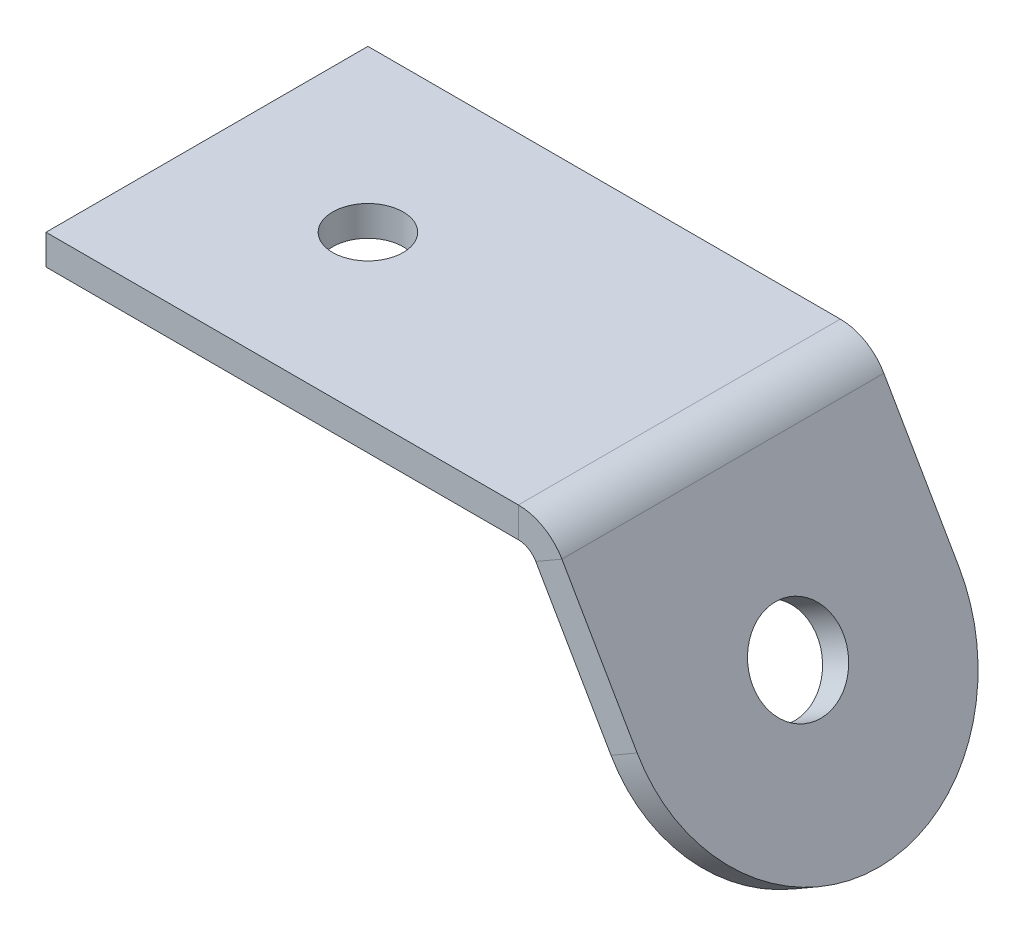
ISO-10303-21;
HEADER;
FILE_DESCRIPTION(('STEP AP214'),'2;1');
FILE_NAME('part.step','',(''),(''),'','','');
FILE_SCHEMA(('AUTOMOTIVE_DESIGN { 1 0 10303 214 1 1 1 1 }'));
ENDSEC;
DATA;
#1=APPLICATION_CONTEXT('core data for automotive mechanical design processes');
#2=APPLICATION_PROTOCOL_DEFINITION('international standard','automotive_design',2000,#1);
#3=PRODUCT_CONTEXT('',#1,'mechanical');
#4=PRODUCT('Part','Part','',(#3));
#5=PRODUCT_RELATED_PRODUCT_CATEGORY('part','',(#4));
#6=PRODUCT_DEFINITION_FORMATION('','',#4);
#7=PRODUCT_DEFINITION_CONTEXT('part definition',#1,'design');
#8=PRODUCT_DEFINITION('design','',#6,#7);
#9=PRODUCT_DEFINITION_SHAPE('','',#8);
#10=(LENGTH_UNIT() NAMED_UNIT(*) SI_UNIT(.MILLI.,.METRE.));
#11=(NAMED_UNIT(*) PLANE_ANGLE_UNIT() SI_UNIT($,.RADIAN.));
#12=(NAMED_UNIT(*) SI_UNIT($,.STERADIAN.) SOLID_ANGLE_UNIT());
#13=UNCERTAINTY_MEASURE_WITH_UNIT(LENGTH_MEASURE(1.E-05),#10,'distance_accuracy_value','');
#14=(GEOMETRIC_REPRESENTATION_CONTEXT(3) GLOBAL_UNCERTAINTY_ASSIGNED_CONTEXT((#13)) GLOBAL_UNIT_ASSIGNED_CONTEXT((#10,
#11,#12)) REPRESENTATION_CONTEXT('',''));
#15=CARTESIAN_POINT('',(0.,0.,0.));
#16=DIRECTION('',(0.,0.,1.));
#17=DIRECTION('',(1.,0.,0.));
#18=AXIS2_PLACEMENT_3D('',#15,#16,#17);
#19=CARTESIAN_POINT('',(13.3796535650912,21.4880663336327,-16.));
#20=DIRECTION('',(0.,0.,1.));
#21=DIRECTION('',(0.499999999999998,-0.86602540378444,0.));
#22=AXIS2_PLACEMENT_3D('',#19,#20,#21);
#23=PLANE('',#22);
#24=DIRECTION('',(-0.499999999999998,0.86602540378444,0.));
#25=VECTOR('',#24,1.);
#26=CARTESIAN_POINT('',(12.0806154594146,20.7380663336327,-16.));
#27=LINE('',#26,#25);
#28=CARTESIAN_POINT('',(28.0806154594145,-6.97474658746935,-16.));
#29=VERTEX_POINT('',#28);
#30=CARTESIAN_POINT('',(24.3424187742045,-0.500000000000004,-16.));
#31=VERTEX_POINT('',#30);
#32=EDGE_CURVE('E60',#29,#31,#27,.T.);
#33=ORIENTED_EDGE('',*,*,#32,.T.);
#34=DIRECTION('',(0.86602540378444,0.499999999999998,0.));
#35=VECTOR('',#34,1.);
#36=CARTESIAN_POINT('',(25.6414568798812,0.249999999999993,-16.));
#37=LINE('',#36,#35);
#38=CARTESIAN_POINT('',(25.6414568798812,0.249999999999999,-16.));
#39=VERTEX_POINT('',#38);
#40=EDGE_CURVE('E187',#31,#39,#37,.T.);
#41=ORIENTED_EDGE('',*,*,#40,.T.);
#42=DIRECTION('',(-0.499999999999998,0.86602540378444,0.));
#43=VECTOR('',#42,1.);
#44=CARTESIAN_POINT('',(13.3796535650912,21.4880663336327,-16.));
#45=LINE('',#44,#43);
#46=CARTESIAN_POINT('',(29.3796535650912,-6.22474658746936,-16.));
#47=VERTEX_POINT('',#46);
#48=EDGE_CURVE('E178',#47,#39,#45,.T.);
#49=ORIENTED_EDGE('',*,*,#48,.F.);
#50=DIRECTION('',(-0.86602540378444,-0.499999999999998,0.));
#51=VECTOR('',#50,1.);
#52=CARTESIAN_POINT('',(29.3796535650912,-6.22474658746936,-16.));
#53=LINE('',#52,#51);
#54=EDGE_CURVE('E181',#47,#29,#53,.T.);
#55=ORIENTED_EDGE('',*,*,#54,.T.);
#56=EDGE_LOOP('',(#33,#41,#49,#55));
#57=FACE_BOUND('',#56,.T.);
#58=ADVANCED_FACE('F36',(#57),#23,.F.);
#59=CARTESIAN_POINT('',(13.3796535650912,21.4880663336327,0.));
#60=DIRECTION('',(0.,0.,-1.));
#61=DIRECTION('',(-0.499999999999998,0.86602540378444,0.));
#62=AXIS2_PLACEMENT_3D('',#59,#60,#61);
#63=PLANE('',#62);
#64=DIRECTION('',(0.499999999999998,-0.86602540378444,0.));
#65=VECTOR('',#64,1.);
#66=CARTESIAN_POINT('',(13.3796535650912,21.4880663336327,0.));
#67=LINE('',#66,#65);
#68=CARTESIAN_POINT('',(25.6414568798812,0.249999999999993,0.));
#69=VERTEX_POINT('',#68);
#70=CARTESIAN_POINT('',(29.3796535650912,-6.22474658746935,0.));
#71=VERTEX_POINT('',#70);
#72=EDGE_CURVE('E40',#69,#71,#67,.T.);
#73=ORIENTED_EDGE('',*,*,#72,.F.);
#74=DIRECTION('',(-0.86602540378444,-0.499999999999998,0.));
#75=VECTOR('',#74,1.);
#76=CARTESIAN_POINT('',(25.6414568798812,0.249999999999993,0.));
#77=LINE('',#76,#75);
#78=CARTESIAN_POINT('',(24.3424187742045,-0.500000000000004,0.));
#79=VERTEX_POINT('',#78);
#80=EDGE_CURVE('E12',#69,#79,#77,.T.);
#81=ORIENTED_EDGE('',*,*,#80,.T.);
#82=DIRECTION('',(0.499999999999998,-0.86602540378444,0.));
#83=VECTOR('',#82,1.);
#84=CARTESIAN_POINT('',(12.0806154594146,20.7380663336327,0.));
#85=LINE('',#84,#83);
#86=CARTESIAN_POINT('',(28.0806154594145,-6.97474658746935,0.));
#87=VERTEX_POINT('',#86);
#88=EDGE_CURVE('E53',#79,#87,#85,.T.);
#89=ORIENTED_EDGE('',*,*,#88,.T.);
#90=DIRECTION('',(-0.86602540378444,-0.499999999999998,0.));
#91=VECTOR('',#90,1.);
#92=CARTESIAN_POINT('',(29.3796535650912,-6.22474658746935,0.));
#93=LINE('',#92,#91);
#94=EDGE_CURVE('E183',#71,#87,#93,.T.);
#95=ORIENTED_EDGE('',*,*,#94,.F.);
#96=EDGE_LOOP('',(#73,#81,#89,#95));
#97=FACE_BOUND('',#96,.T.);
#98=ADVANCED_FACE('F38',(#97),#63,.F.);
#99=CARTESIAN_POINT('',(28.0806154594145,-6.97474658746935,-8.));
#100=DIRECTION('',(0.86602540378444,0.499999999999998,0.));
#101=DIRECTION('',(0.,0.,1.));
#102=AXIS2_PLACEMENT_3D('',#99,#100,#101);
#103=PLANE('',#102);
#104=CARTESIAN_POINT('',(28.0806154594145,-6.97474658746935,-8.));
#105=DIRECTION('',(0.86602540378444,0.499999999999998,0.));
#106=DIRECTION('',(0.,0.,1.));
#107=AXIS2_PLACEMENT_3D('',#104,#105,#106);
#108=CIRCLE('',#107,2.25);
#109=CARTESIAN_POINT('',(28.0806154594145,-6.97474658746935,-5.75));
#110=VERTEX_POINT('',#109);
#111=EDGE_CURVE('E153',#110,#110,#108,.T.);
#112=ORIENTED_EDGE('',*,*,#111,.T.);
#113=EDGE_LOOP('',(#112));
#114=FACE_BOUND('',#113,.T.);
#115=ORIENTED_EDGE('',*,*,#88,.F.);
#116=DIRECTION('',(0.,0.,-1.));
#117=VECTOR('',#116,1.);
#118=CARTESIAN_POINT('',(24.3424187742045,-0.5,-8.));
#119=LINE('',#118,#117);
#120=EDGE_CURVE('E45',#79,#31,#119,.T.);
#121=ORIENTED_EDGE('',*,*,#120,.T.);
#122=ORIENTED_EDGE('',*,*,#32,.F.);
#123=CARTESIAN_POINT('',(28.0806154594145,-6.97474658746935,-8.));
#124=DIRECTION('',(0.86602540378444,0.499999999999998,0.));
#125=DIRECTION('',(0.,0.,1.));
#126=AXIS2_PLACEMENT_3D('',#123,#124,#125);
#127=CIRCLE('',#126,8.);
#128=EDGE_CURVE('E179',#87,#29,#127,.T.);
#129=ORIENTED_EDGE('',*,*,#128,.F.);
#130=EDGE_LOOP('',(#115,#121,#122,#129));
#131=FACE_BOUND('',#130,.T.);
#132=ADVANCED_FACE('F235',(#114,#131),#103,.F.);
#133=CARTESIAN_POINT('',(29.3796535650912,-6.22474658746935,-8.));
#134=DIRECTION('',(0.86602540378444,0.499999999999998,0.));
#135=DIRECTION('',(0.,0.,1.));
#136=AXIS2_PLACEMENT_3D('',#133,#134,#135);
#137=PLANE('',#136);
#138=DIRECTION('',(0.,0.,-1.));
#139=VECTOR('',#138,1.);
#140=CARTESIAN_POINT('',(25.6414568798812,0.249999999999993,-8.));
#141=LINE('',#140,#139);
#142=EDGE_CURVE('E139',#69,#39,#141,.T.);
#143=ORIENTED_EDGE('',*,*,#142,.F.);
#144=ORIENTED_EDGE('',*,*,#72,.T.);
#145=CARTESIAN_POINT('',(29.3796535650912,-6.22474658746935,-8.));
#146=DIRECTION('',(0.86602540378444,0.499999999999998,0.));
#147=DIRECTION('',(0.,0.,1.));
#148=AXIS2_PLACEMENT_3D('',#145,#146,#147);
#149=CIRCLE('',#148,8.);
#150=EDGE_CURVE('E176',#71,#47,#149,.T.);
#151=ORIENTED_EDGE('',*,*,#150,.T.);
#152=ORIENTED_EDGE('',*,*,#48,.T.);
#153=EDGE_LOOP('',(#143,#144,#151,#152));
#154=FACE_BOUND('',#153,.T.);
#155=CARTESIAN_POINT('',(29.3796535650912,-6.22474658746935,-8.));
#156=DIRECTION('',(0.86602540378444,0.499999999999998,0.));
#157=DIRECTION('',(0.,0.,1.));
#158=AXIS2_PLACEMENT_3D('',#155,#156,#157);
#159=CIRCLE('',#158,2.25);
#160=CARTESIAN_POINT('',(29.3796535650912,-6.22474658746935,-5.75));
#161=VERTEX_POINT('',#160);
#162=EDGE_CURVE('E171',#161,#161,#159,.T.);
#163=ORIENTED_EDGE('',*,*,#162,.F.);
#164=EDGE_LOOP('',(#163));
#165=FACE_BOUND('',#164,.T.);
#166=ADVANCED_FACE('F194',(#154,#165),#137,.T.);
#167=CARTESIAN_POINT('',(29.3796535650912,-6.22474658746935,-8.));
#168=DIRECTION('',(-0.86602540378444,-0.499999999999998,0.));
#169=DIRECTION('',(0.,0.,-1.));
#170=AXIS2_PLACEMENT_3D('',#167,#168,#169);
#171=CYLINDRICAL_SURFACE('',#170,8.);
#172=ORIENTED_EDGE('',*,*,#128,.T.);
#173=ORIENTED_EDGE('',*,*,#54,.F.);
#174=ORIENTED_EDGE('',*,*,#150,.F.);
#175=ORIENTED_EDGE('',*,*,#94,.T.);
#176=EDGE_LOOP('',(#172,#173,#174,#175));
#177=FACE_BOUND('',#176,.T.);
#178=ADVANCED_FACE('F226',(#177),#171,.T.);
#179=CARTESIAN_POINT('',(29.3796535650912,-6.22474658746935,-8.));
#180=DIRECTION('',(-0.86602540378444,-0.499999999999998,0.));
#181=DIRECTION('',(0.,0.,-1.));
#182=AXIS2_PLACEMENT_3D('',#179,#180,#181);
#183=CYLINDRICAL_SURFACE('',#182,2.25);
#184=ORIENTED_EDGE('',*,*,#162,.T.);
#185=EDGE_LOOP('',(#184));
#186=FACE_BOUND('',#185,.T.);
#187=ORIENTED_EDGE('',*,*,#111,.F.);
#188=EDGE_LOOP('',(#187));
#189=FACE_BOUND('',#188,.T.);
#190=ADVANCED_FACE('F218',(#186,#189),#183,.F.);
#191=CARTESIAN_POINT('',(0.,1.5,0.));
#192=DIRECTION('',(1.,0.,0.));
#193=DIRECTION('',(0.,0.,-1.));
#194=AXIS2_PLACEMENT_3D('',#191,#192,#193);
#195=PLANE('',#194);
#196=DIRECTION('',(0.,0.,1.));
#197=VECTOR('',#196,1.);
#198=CARTESIAN_POINT('',(0.,0.,0.));
#199=LINE('',#198,#197);
#200=CARTESIAN_POINT('',(0.,0.,-16.));
#201=VERTEX_POINT('',#200);
#202=CARTESIAN_POINT('',(0.,0.,0.));
#203=VERTEX_POINT('',#202);
#204=EDGE_CURVE('E134',#201,#203,#199,.T.);
#205=ORIENTED_EDGE('',*,*,#204,.T.);
#206=DIRECTION('',(0.,-1.,0.));
#207=VECTOR('',#206,1.);
#208=CARTESIAN_POINT('',(0.,1.5,0.));
#209=LINE('',#208,#207);
#210=CARTESIAN_POINT('',(0.,1.5,0.));
#211=VERTEX_POINT('',#210);
#212=EDGE_CURVE('E154',#211,#203,#209,.T.);
#213=ORIENTED_EDGE('',*,*,#212,.F.);
#214=DIRECTION('',(0.,0.,1.));
#215=VECTOR('',#214,1.);
#216=CARTESIAN_POINT('',(0.,1.5,0.));
#217=LINE('',#216,#215);
#218=CARTESIAN_POINT('',(0.,1.5,-16.));
#219=VERTEX_POINT('',#218);
#220=EDGE_CURVE('E114',#219,#211,#217,.T.);
#221=ORIENTED_EDGE('',*,*,#220,.F.);
#222=DIRECTION('',(0.,-1.,0.));
#223=VECTOR('',#222,1.);
#224=CARTESIAN_POINT('',(0.,1.5,-16.));
#225=LINE('',#224,#223);
#226=EDGE_CURVE('E110',#219,#201,#225,.T.);
#227=ORIENTED_EDGE('',*,*,#226,.T.);
#228=EDGE_LOOP('',(#205,#213,#221,#227));
#229=FACE_BOUND('',#228,.T.);
#230=ADVANCED_FACE('F215',(#229),#195,.F.);
#231=CARTESIAN_POINT('',(8.,1.5,-8.));
#232=DIRECTION('',(0.,-1.,0.));
#233=DIRECTION('',(0.,0.,-1.));
#234=AXIS2_PLACEMENT_3D('',#231,#232,#233);
#235=CYLINDRICAL_SURFACE('',#234,1.75);
#236=CARTESIAN_POINT('',(8.,1.5,-8.));
#237=DIRECTION('',(0.,1.,0.));
#238=DIRECTION('',(0.,0.,1.));
#239=AXIS2_PLACEMENT_3D('',#236,#237,#238);
#240=CIRCLE('',#239,1.75);
#241=CARTESIAN_POINT('',(8.,1.5,-6.25));
#242=VERTEX_POINT('',#241);
#243=EDGE_CURVE('E164',#242,#242,#240,.T.);
#244=ORIENTED_EDGE('',*,*,#243,.T.);
#245=EDGE_LOOP('',(#244));
#246=FACE_BOUND('',#245,.T.);
#247=CARTESIAN_POINT('',(8.,0.,-8.));
#248=DIRECTION('',(0.,1.,0.));
#249=DIRECTION('',(0.,0.,1.));
#250=AXIS2_PLACEMENT_3D('',#247,#248,#249);
#251=CIRCLE('',#250,1.75);
#252=CARTESIAN_POINT('',(8.,0.,-6.25));
#253=VERTEX_POINT('',#252);
#254=EDGE_CURVE('E157',#253,#253,#251,.T.);
#255=ORIENTED_EDGE('',*,*,#254,.F.);
#256=EDGE_LOOP('',(#255));
#257=FACE_BOUND('',#256,.T.);
#258=ADVANCED_FACE('F217',(#246,#257),#235,.F.);
#259=CARTESIAN_POINT('',(32.,1.5,-8.));
#260=DIRECTION('',(0.,1.,0.));
#261=DIRECTION('',(0.,0.,1.));
#262=AXIS2_PLACEMENT_3D('',#259,#260,#261);
#263=PLANE('',#262);
#264=ORIENTED_EDGE('',*,*,#243,.F.);
#265=EDGE_LOOP('',(#264));
#266=FACE_BOUND('',#265,.T.);
#267=DIRECTION('',(1.,0.,0.));
#268=VECTOR('',#267,1.);
#269=CARTESIAN_POINT('',(0.,1.5,0.));
#270=LINE('',#269,#268);
#271=CARTESIAN_POINT('',(23.4763933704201,1.5,0.));
#272=VERTEX_POINT('',#271);
#273=EDGE_CURVE('E119',#211,#272,#270,.T.);
#274=ORIENTED_EDGE('',*,*,#273,.T.);
#275=DIRECTION('',(0.,0.,-1.));
#276=VECTOR('',#275,1.);
#277=CARTESIAN_POINT('',(23.4763933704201,1.5,-8.));
#278=LINE('',#277,#276);
#279=CARTESIAN_POINT('',(23.4763933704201,1.5,-16.));
#280=VERTEX_POINT('',#279);
#281=EDGE_CURVE('E115',#272,#280,#278,.T.);
#282=ORIENTED_EDGE('',*,*,#281,.T.);
#283=DIRECTION('',(-1.,0.,0.));
#284=VECTOR('',#283,1.);
#285=CARTESIAN_POINT('',(0.,1.5,-16.));
#286=LINE('',#285,#284);
#287=EDGE_CURVE('E103',#280,#219,#286,.T.);
#288=ORIENTED_EDGE('',*,*,#287,.T.);
#289=ORIENTED_EDGE('',*,*,#220,.T.);
#290=EDGE_LOOP('',(#274,#282,#288,#289));
#291=FACE_BOUND('',#290,.T.);
#292=ADVANCED_FACE('F118',(#266,#291),#263,.T.);
#293=CARTESIAN_POINT('',(0.,1.5,-16.));
#294=DIRECTION('',(0.,0.,1.));
#295=DIRECTION('',(1.,0.,0.));
#296=AXIS2_PLACEMENT_3D('',#293,#294,#295);
#297=PLANE('',#296);
#298=DIRECTION('',(0.,1.,0.));
#299=VECTOR('',#298,1.);
#300=CARTESIAN_POINT('',(23.4763933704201,1.5,-16.));
#301=LINE('',#300,#299);
#302=CARTESIAN_POINT('',(23.4763933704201,0.,-16.));
#303=VERTEX_POINT('',#302);
#304=EDGE_CURVE('E107',#303,#280,#301,.T.);
#305=ORIENTED_EDGE('',*,*,#304,.F.);
#306=DIRECTION('',(-1.,0.,0.));
#307=VECTOR('',#306,1.);
#308=CARTESIAN_POINT('',(0.,0.,-16.));
#309=LINE('',#308,#307);
#310=EDGE_CURVE('E160',#303,#201,#309,.T.);
#311=ORIENTED_EDGE('',*,*,#310,.T.);
#312=ORIENTED_EDGE('',*,*,#226,.F.);
#313=ORIENTED_EDGE('',*,*,#287,.F.);
#314=EDGE_LOOP('',(#305,#311,#312,#313));
#315=FACE_BOUND('',#314,.T.);
#316=ADVANCED_FACE('F105',(#315),#297,.F.);
#317=CARTESIAN_POINT('',(32.,0.,-8.));
#318=DIRECTION('',(0.,1.,0.));
#319=DIRECTION('',(0.,0.,1.));
#320=AXIS2_PLACEMENT_3D('',#317,#318,#319);
#321=PLANE('',#320);
#322=DIRECTION('',(0.,0.,-1.));
#323=VECTOR('',#322,1.);
#324=CARTESIAN_POINT('',(23.4763933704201,0.,-8.));
#325=LINE('',#324,#323);
#326=CARTESIAN_POINT('',(23.4763933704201,0.,0.));
#327=VERTEX_POINT('',#326);
#328=EDGE_CURVE('E135',#327,#303,#325,.T.);
#329=ORIENTED_EDGE('',*,*,#328,.F.);
#330=DIRECTION('',(1.,0.,0.));
#331=VECTOR('',#330,1.);
#332=CARTESIAN_POINT('',(0.,0.,0.));
#333=LINE('',#332,#331);
#334=EDGE_CURVE('E151',#203,#327,#333,.T.);
#335=ORIENTED_EDGE('',*,*,#334,.F.);
#336=ORIENTED_EDGE('',*,*,#204,.F.);
#337=ORIENTED_EDGE('',*,*,#310,.F.);
#338=EDGE_LOOP('',(#329,#335,#336,#337));
#339=FACE_BOUND('',#338,.T.);
#340=ORIENTED_EDGE('',*,*,#254,.T.);
#341=EDGE_LOOP('',(#340));
#342=FACE_BOUND('',#341,.T.);
#343=ADVANCED_FACE('F205',(#339,#342),#321,.F.);
#344=CARTESIAN_POINT('',(0.,1.5,0.));
#345=DIRECTION('',(0.,0.,-1.));
#346=DIRECTION('',(-1.,0.,0.));
#347=AXIS2_PLACEMENT_3D('',#344,#345,#346);
#348=PLANE('',#347);
#349=DIRECTION('',(0.,-1.,0.));
#350=VECTOR('',#349,1.);
#351=CARTESIAN_POINT('',(23.4763933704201,1.5,0.));
#352=LINE('',#351,#350);
#353=EDGE_CURVE('E140',#272,#327,#352,.T.);
#354=ORIENTED_EDGE('',*,*,#353,.F.);
#355=ORIENTED_EDGE('',*,*,#273,.F.);
#356=ORIENTED_EDGE('',*,*,#212,.T.);
#357=ORIENTED_EDGE('',*,*,#334,.T.);
#358=EDGE_LOOP('',(#354,#355,#356,#357));
#359=FACE_BOUND('',#358,.T.);
#360=ADVANCED_FACE('F212',(#359),#348,.F.);
#361=CARTESIAN_POINT('',(23.4763933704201,-1.,0.));
#362=DIRECTION('',(0.,0.,1.));
#363=DIRECTION('',(1.,0.,0.));
#364=AXIS2_PLACEMENT_3D('',#361,#362,#363);
#365=PLANE('',#364);
#366=ORIENTED_EDGE('',*,*,#353,.T.);
#367=CARTESIAN_POINT('',(23.4763933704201,-1.,0.));
#368=DIRECTION('',(0.,0.,-1.));
#369=DIRECTION('',(-1.,0.,0.));
#370=AXIS2_PLACEMENT_3D('',#367,#368,#369);
#371=CIRCLE('',#370,1.);
#372=EDGE_CURVE('E147',#327,#79,#371,.T.);
#373=ORIENTED_EDGE('',*,*,#372,.T.);
#374=ORIENTED_EDGE('',*,*,#80,.F.);
#375=CARTESIAN_POINT('',(23.4763933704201,-1.,0.));
#376=DIRECTION('',(0.,0.,-1.));
#377=DIRECTION('',(-1.,0.,0.));
#378=AXIS2_PLACEMENT_3D('',#375,#376,#377);
#379=CIRCLE('',#378,2.5);
#380=EDGE_CURVE('E141',#272,#69,#379,.T.);
#381=ORIENTED_EDGE('',*,*,#380,.F.);
#382=EDGE_LOOP('',(#366,#373,#374,#381));
#383=FACE_BOUND('',#382,.T.);
#384=ADVANCED_FACE('F209',(#383),#365,.T.);
#385=CARTESIAN_POINT('',(23.4763933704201,-1.,-16.));
#386=DIRECTION('',(0.,0.,-1.));
#387=DIRECTION('',(-1.,0.,0.));
#388=AXIS2_PLACEMENT_3D('',#385,#386,#387);
#389=PLANE('',#388);
#390=CARTESIAN_POINT('',(23.4763933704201,-1.,-16.));
#391=DIRECTION('',(0.,0.,-1.));
#392=DIRECTION('',(-1.,0.,0.));
#393=AXIS2_PLACEMENT_3D('',#390,#391,#392);
#394=CIRCLE('',#393,1.);
#395=EDGE_CURVE('E133',#31,#303,#394,.F.);
#396=ORIENTED_EDGE('',*,*,#395,.T.);
#397=ORIENTED_EDGE('',*,*,#304,.T.);
#398=CARTESIAN_POINT('',(23.4763933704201,-1.,-16.));
#399=DIRECTION('',(0.,0.,1.));
#400=DIRECTION('',(1.,0.,0.));
#401=AXIS2_PLACEMENT_3D('',#398,#399,#400);
#402=CIRCLE('',#401,2.5);
#403=EDGE_CURVE('E131',#39,#280,#402,.T.);
#404=ORIENTED_EDGE('',*,*,#403,.F.);
#405=ORIENTED_EDGE('',*,*,#40,.F.);
#406=EDGE_LOOP('',(#396,#397,#404,#405));
#407=FACE_BOUND('',#406,.T.);
#408=ADVANCED_FACE('F129',(#407),#389,.T.);
#409=CARTESIAN_POINT('',(23.4763933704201,-1.,8.10424340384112));
#410=DIRECTION('',(0.,0.,-1.));
#411=DIRECTION('',(-1.,0.,0.));
#412=AXIS2_PLACEMENT_3D('',#409,#410,#411);
#413=CYLINDRICAL_SURFACE('',#412,2.5);
#414=ORIENTED_EDGE('',*,*,#142,.T.);
#415=ORIENTED_EDGE('',*,*,#403,.T.);
#416=ORIENTED_EDGE('',*,*,#281,.F.);
#417=ORIENTED_EDGE('',*,*,#380,.T.);
#418=EDGE_LOOP('',(#414,#415,#416,#417));
#419=FACE_BOUND('',#418,.T.);
#420=ADVANCED_FACE('F138',(#419),#413,.T.);
#421=CARTESIAN_POINT('',(23.4763933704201,-1.,8.10424340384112));
#422=DIRECTION('',(0.,0.,-1.));
#423=DIRECTION('',(-1.,0.,0.));
#424=AXIS2_PLACEMENT_3D('',#421,#422,#423);
#425=CYLINDRICAL_SURFACE('',#424,1.);
#426=ORIENTED_EDGE('',*,*,#120,.F.);
#427=ORIENTED_EDGE('',*,*,#372,.F.);
#428=ORIENTED_EDGE('',*,*,#328,.T.);
#429=ORIENTED_EDGE('',*,*,#395,.F.);
#430=EDGE_LOOP('',(#426,#427,#428,#429));
#431=FACE_BOUND('',#430,.T.);
#432=ADVANCED_FACE('F201',(#431),#425,.F.);
#433=CLOSED_SHELL('',(#58,#98,#132,#166,#178,#190,#230,#258,#292,#316,#343,#360,#384,#408,#420,#432));
#434=MANIFOLD_SOLID_BREP('B2',#433);
#435=ADVANCED_BREP_SHAPE_REPRESENTATION('',(#18,#434),#14);
#436=SHAPE_DEFINITION_REPRESENTATION(#9,#435);
ENDSEC;
END-ISO-10303-21;
